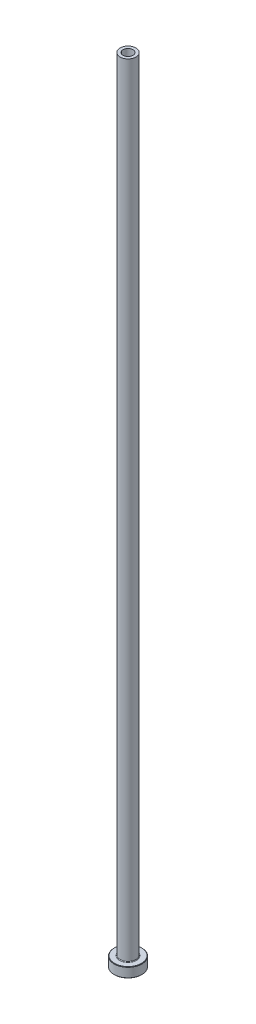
ISO-10303-21;
HEADER;
FILE_DESCRIPTION(('STEP AP214'),'2;1');
FILE_NAME('part.step','',(''),(''),'','','');
FILE_SCHEMA(('AUTOMOTIVE_DESIGN { 1 0 10303 214 1 1 1 1 }'));
ENDSEC;
DATA;
#1=APPLICATION_CONTEXT('core data for automotive mechanical design processes');
#2=APPLICATION_PROTOCOL_DEFINITION('international standard','automotive_design',2000,#1);
#3=PRODUCT_CONTEXT('',#1,'mechanical');
#4=PRODUCT('Part','Part','',(#3));
#5=PRODUCT_RELATED_PRODUCT_CATEGORY('part','',(#4));
#6=PRODUCT_DEFINITION_FORMATION('','',#4);
#7=PRODUCT_DEFINITION_CONTEXT('part definition',#1,'design');
#8=PRODUCT_DEFINITION('design','',#6,#7);
#9=PRODUCT_DEFINITION_SHAPE('','',#8);
#10=(LENGTH_UNIT() NAMED_UNIT(*) SI_UNIT(.MILLI.,.METRE.));
#11=(NAMED_UNIT(*) PLANE_ANGLE_UNIT() SI_UNIT($,.RADIAN.));
#12=(NAMED_UNIT(*) SI_UNIT($,.STERADIAN.) SOLID_ANGLE_UNIT());
#13=UNCERTAINTY_MEASURE_WITH_UNIT(LENGTH_MEASURE(1.E-05),#10,'distance_accuracy_value','');
#14=(GEOMETRIC_REPRESENTATION_CONTEXT(3) GLOBAL_UNCERTAINTY_ASSIGNED_CONTEXT((#13)) GLOBAL_UNIT_ASSIGNED_CONTEXT((#10,
#11,#12)) REPRESENTATION_CONTEXT('',''));
#15=CARTESIAN_POINT('',(0.,0.,0.));
#16=DIRECTION('',(0.,0.,1.));
#17=DIRECTION('',(1.,0.,0.));
#18=AXIS2_PLACEMENT_3D('',#15,#16,#17);
#19=CARTESIAN_POINT('',(0.,92.1876809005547,0.));
#20=DIRECTION('',(0.,1.,0.));
#21=DIRECTION('',(0.,0.,1.));
#22=AXIS2_PLACEMENT_3D('',#19,#20,#21);
#23=CYLINDRICAL_SURFACE('',#22,2.50000000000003);
#24=CARTESIAN_POINT('',(0.,400.,0.));
#25=DIRECTION('',(0.,1.,0.));
#26=DIRECTION('',(0.,0.,1.));
#27=AXIS2_PLACEMENT_3D('',#24,#25,#26);
#28=CIRCLE('',#27,2.50000000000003);
#29=CARTESIAN_POINT('',(0.,400.,2.50000000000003));
#30=VERTEX_POINT('',#29);
#31=EDGE_CURVE('E62',#30,#30,#28,.T.);
#32=ORIENTED_EDGE('',*,*,#31,.T.);
#33=EDGE_LOOP('',(#32));
#34=FACE_BOUND('',#33,.T.);
#35=CARTESIAN_POINT('',(0.,355.,0.));
#36=DIRECTION('',(0.,1.,0.));
#37=DIRECTION('',(0.,0.,1.));
#38=AXIS2_PLACEMENT_3D('',#35,#36,#37);
#39=CIRCLE('',#38,2.50000000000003);
#40=CARTESIAN_POINT('',(0.,355.,2.50000000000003));
#41=VERTEX_POINT('',#40);
#42=EDGE_CURVE('E71',#41,#41,#39,.T.);
#43=ORIENTED_EDGE('',*,*,#42,.F.);
#44=EDGE_LOOP('',(#43));
#45=FACE_BOUND('',#44,.T.);
#46=ADVANCED_FACE('F30',(#34,#45),#23,.F.);
#47=CARTESIAN_POINT('',(-2.50000000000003,400.,0.));
#48=DIRECTION('',(0.,1.,0.));
#49=DIRECTION('',(0.,0.,1.));
#50=AXIS2_PLACEMENT_3D('',#47,#48,#49);
#51=PLANE('',#50);
#52=CARTESIAN_POINT('',(0.,400.,0.));
#53=DIRECTION('',(0.,1.,0.));
#54=DIRECTION('',(0.,0.,1.));
#55=AXIS2_PLACEMENT_3D('',#52,#53,#54);
#56=CIRCLE('',#55,4.00000000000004);
#57=CARTESIAN_POINT('',(0.,400.,4.00000000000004));
#58=VERTEX_POINT('',#57);
#59=EDGE_CURVE('E65',#58,#58,#56,.T.);
#60=ORIENTED_EDGE('',*,*,#59,.T.);
#61=EDGE_LOOP('',(#60));
#62=FACE_BOUND('',#61,.T.);
#63=ORIENTED_EDGE('',*,*,#31,.F.);
#64=EDGE_LOOP('',(#63));
#65=FACE_BOUND('',#64,.T.);
#66=ADVANCED_FACE('F79',(#62,#65),#51,.T.);
#67=CARTESIAN_POINT('',(0.,92.1876809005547,0.));
#68=DIRECTION('',(0.,1.,0.));
#69=DIRECTION('',(0.,0.,1.));
#70=AXIS2_PLACEMENT_3D('',#67,#68,#69);
#71=CYLINDRICAL_SURFACE('',#70,4.00000000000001);
#72=CARTESIAN_POINT('',(0.,5.3,0.));
#73=DIRECTION('',(0.,1.,0.));
#74=DIRECTION('',(0.,0.,1.));
#75=AXIS2_PLACEMENT_3D('',#72,#73,#74);
#76=CIRCLE('',#75,4.00000000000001);
#77=CARTESIAN_POINT('',(0.,5.3,4.00000000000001));
#78=VERTEX_POINT('',#77);
#79=EDGE_CURVE('E59',#78,#78,#76,.T.);
#80=ORIENTED_EDGE('',*,*,#79,.T.);
#81=EDGE_LOOP('',(#80));
#82=FACE_BOUND('',#81,.T.);
#83=ORIENTED_EDGE('',*,*,#59,.F.);
#84=EDGE_LOOP('',(#83));
#85=FACE_BOUND('',#84,.T.);
#86=ADVANCED_FACE('F85',(#82,#85),#71,.T.);
#87=CARTESIAN_POINT('',(-3.99999999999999,5.,0.));
#88=DIRECTION('',(0.,1.,0.));
#89=DIRECTION('',(0.,0.,1.));
#90=AXIS2_PLACEMENT_3D('',#87,#88,#89);
#91=PLANE('',#90);
#92=CARTESIAN_POINT('',(0.,5.,0.));
#93=DIRECTION('',(0.,1.,0.));
#94=DIRECTION('',(0.,0.,1.));
#95=AXIS2_PLACEMENT_3D('',#92,#93,#94);
#96=CIRCLE('',#95,6.80000000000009);
#97=CARTESIAN_POINT('',(0.,5.,-6.80000000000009));
#98=VERTEX_POINT('',#97);
#99=EDGE_CURVE('E53',#98,#98,#96,.T.);
#100=ORIENTED_EDGE('',*,*,#99,.T.);
#101=EDGE_LOOP('',(#100));
#102=FACE_BOUND('',#101,.T.);
#103=CARTESIAN_POINT('',(0.,5.,0.));
#104=DIRECTION('',(0.,1.,0.));
#105=DIRECTION('',(0.,0.,1.));
#106=AXIS2_PLACEMENT_3D('',#103,#104,#105);
#107=CIRCLE('',#106,4.30000000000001);
#108=CARTESIAN_POINT('',(0.,5.,4.30000000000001));
#109=VERTEX_POINT('',#108);
#110=EDGE_CURVE('E56',#109,#109,#107,.F.);
#111=ORIENTED_EDGE('',*,*,#110,.T.);
#112=EDGE_LOOP('',(#111));
#113=FACE_BOUND('',#112,.T.);
#114=ADVANCED_FACE('F111',(#102,#113),#91,.T.);
#115=CARTESIAN_POINT('',(0.,92.1876809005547,0.));
#116=DIRECTION('',(0.,1.,0.));
#117=DIRECTION('',(0.,0.,1.));
#118=AXIS2_PLACEMENT_3D('',#115,#116,#117);
#119=CYLINDRICAL_SURFACE('',#118,6.99999999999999);
#120=CARTESIAN_POINT('',(0.,4.80000000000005,0.));
#121=DIRECTION('',(0.,1.,0.));
#122=DIRECTION('',(0.,0.,1.));
#123=AXIS2_PLACEMENT_3D('',#120,#121,#122);
#124=CIRCLE('',#123,6.99999999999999);
#125=CARTESIAN_POINT('',(0.,4.80000000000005,-6.99999999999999));
#126=VERTEX_POINT('',#125);
#127=EDGE_CURVE('E45',#126,#126,#124,.F.);
#128=ORIENTED_EDGE('',*,*,#127,.T.);
#129=EDGE_LOOP('',(#128));
#130=FACE_BOUND('',#129,.T.);
#131=CARTESIAN_POINT('',(0.,0.200000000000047,0.));
#132=DIRECTION('',(0.,-1.,0.));
#133=DIRECTION('',(0.,0.,-1.));
#134=AXIS2_PLACEMENT_3D('',#131,#132,#133);
#135=CIRCLE('',#134,6.99999999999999);
#136=CARTESIAN_POINT('',(0.,0.200000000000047,-6.99999999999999));
#137=VERTEX_POINT('',#136);
#138=EDGE_CURVE('E50',#137,#137,#135,.F.);
#139=ORIENTED_EDGE('',*,*,#138,.T.);
#140=EDGE_LOOP('',(#139));
#141=FACE_BOUND('',#140,.T.);
#142=ADVANCED_FACE('F108',(#130,#141),#119,.T.);
#143=CARTESIAN_POINT('',(-6.99999999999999,0.,0.));
#144=DIRECTION('',(0.,-1.,0.));
#145=DIRECTION('',(0.,0.,-1.));
#146=AXIS2_PLACEMENT_3D('',#143,#144,#145);
#147=PLANE('',#146);
#148=CARTESIAN_POINT('',(0.,0.,0.));
#149=DIRECTION('',(0.,-1.,0.));
#150=DIRECTION('',(0.,0.,-1.));
#151=AXIS2_PLACEMENT_3D('',#148,#149,#150);
#152=CIRCLE('',#151,3.24999999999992);
#153=CARTESIAN_POINT('',(0.,0.,-3.24999999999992));
#154=VERTEX_POINT('',#153);
#155=EDGE_CURVE('E37',#154,#154,#152,.F.);
#156=ORIENTED_EDGE('',*,*,#155,.T.);
#157=EDGE_LOOP('',(#156));
#158=FACE_BOUND('',#157,.T.);
#159=CARTESIAN_POINT('',(0.,0.,0.));
#160=DIRECTION('',(0.,-1.,0.));
#161=DIRECTION('',(0.,0.,-1.));
#162=AXIS2_PLACEMENT_3D('',#159,#160,#161);
#163=CIRCLE('',#162,6.79999999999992);
#164=CARTESIAN_POINT('',(0.,0.,-6.79999999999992));
#165=VERTEX_POINT('',#164);
#166=EDGE_CURVE('E41',#165,#165,#163,.T.);
#167=ORIENTED_EDGE('',*,*,#166,.T.);
#168=EDGE_LOOP('',(#167));
#169=FACE_BOUND('',#168,.T.);
#170=ADVANCED_FACE('F110',(#158,#169),#147,.T.);
#171=CARTESIAN_POINT('',(0.,92.1876809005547,0.));
#172=DIRECTION('',(0.,1.,0.));
#173=DIRECTION('',(0.,0.,1.));
#174=AXIS2_PLACEMENT_3D('',#171,#172,#173);
#175=CYLINDRICAL_SURFACE('',#174,2.75000000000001);
#176=CARTESIAN_POINT('',(0.,0.499999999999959,0.));
#177=DIRECTION('',(0.,-1.,0.));
#178=DIRECTION('',(0.,0.,-1.));
#179=AXIS2_PLACEMENT_3D('',#176,#177,#178);
#180=CIRCLE('',#179,2.75000000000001);
#181=CARTESIAN_POINT('',(0.,0.499999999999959,-2.75000000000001));
#182=VERTEX_POINT('',#181);
#183=EDGE_CURVE('E10',#182,#182,#180,.T.);
#184=ORIENTED_EDGE('',*,*,#183,.T.);
#185=EDGE_LOOP('',(#184));
#186=FACE_BOUND('',#185,.T.);
#187=CARTESIAN_POINT('',(0.,343.,0.));
#188=DIRECTION('',(0.,1.,0.));
#189=DIRECTION('',(0.,0.,1.));
#190=AXIS2_PLACEMENT_3D('',#187,#188,#189);
#191=CIRCLE('',#190,2.75000000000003);
#192=CARTESIAN_POINT('',(0.,343.,2.75000000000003));
#193=VERTEX_POINT('',#192);
#194=EDGE_CURVE('E68',#193,#193,#191,.T.);
#195=ORIENTED_EDGE('',*,*,#194,.T.);
#196=EDGE_LOOP('',(#195));
#197=FACE_BOUND('',#196,.T.);
#198=ADVANCED_FACE('F118',(#186,#197),#175,.F.);
#199=CARTESIAN_POINT('',(0.,343.,0.));
#200=DIRECTION('',(0.,-1.,0.));
#201=DIRECTION('',(0.,0.,-1.));
#202=AXIS2_PLACEMENT_3D('',#199,#200,#201);
#203=CONICAL_SURFACE('',#202,2.75000000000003,0.0208303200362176);
#204=ORIENTED_EDGE('',*,*,#42,.T.);
#205=EDGE_LOOP('',(#204));
#206=FACE_BOUND('',#205,.T.);
#207=ORIENTED_EDGE('',*,*,#194,.F.);
#208=EDGE_LOOP('',(#207));
#209=FACE_BOUND('',#208,.T.);
#210=ADVANCED_FACE('F75',(#206,#209),#203,.F.);
#211=CARTESIAN_POINT('',(0.,5.3,0.));
#212=DIRECTION('',(0.,1.,0.));
#213=DIRECTION('',(0.,0.,1.));
#214=AXIS2_PLACEMENT_3D('',#211,#212,#213);
#215=TOROIDAL_SURFACE('',#214,4.30000000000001,0.3);
#216=ORIENTED_EDGE('',*,*,#110,.F.);
#217=EDGE_LOOP('',(#216));
#218=FACE_BOUND('',#217,.T.);
#219=ORIENTED_EDGE('',*,*,#79,.F.);
#220=EDGE_LOOP('',(#219));
#221=FACE_BOUND('',#220,.T.);
#222=ADVANCED_FACE('F90',(#218,#221),#215,.F.);
#223=CARTESIAN_POINT('',(0.,5.,0.));
#224=DIRECTION('',(0.,-1.,0.));
#225=DIRECTION('',(0.,0.,-1.));
#226=AXIS2_PLACEMENT_3D('',#223,#224,#225);
#227=CONICAL_SURFACE('',#226,6.80000000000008,0.785398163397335);
#228=CARTESIAN_POINT('',(0.,4.80000000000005,-6.99999999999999));
#229=CARTESIAN_POINT('',(0.,4.80208333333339,-6.99791666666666));
#230=CARTESIAN_POINT('',(0.,4.80416666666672,-6.99583333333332));
#231=CARTESIAN_POINT('',(0.,4.80833333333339,-6.99166666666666));
#232=CARTESIAN_POINT('',(0.,4.81041666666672,-6.98958333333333));
#233=CARTESIAN_POINT('',(0.,4.81458333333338,-6.98541666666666));
#234=CARTESIAN_POINT('',(0.,4.81666666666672,-6.98333333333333));
#235=CARTESIAN_POINT('',(0.,4.82083333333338,-6.97916666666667));
#236=CARTESIAN_POINT('',(0.,4.82291666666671,-6.97708333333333));
#237=CARTESIAN_POINT('',(0.,4.82708333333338,-6.97291666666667));
#238=CARTESIAN_POINT('',(0.,4.82916666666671,-6.97083333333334));
#239=CARTESIAN_POINT('',(0.,4.83333333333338,-6.96666666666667));
#240=CARTESIAN_POINT('',(0.,4.83541666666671,-6.96458333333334));
#241=CARTESIAN_POINT('',(0.,4.83958333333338,-6.96041666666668));
#242=CARTESIAN_POINT('',(0.,4.84166666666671,-6.95833333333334));
#243=CARTESIAN_POINT('',(0.,4.84583333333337,-6.95416666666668));
#244=CARTESIAN_POINT('',(0.,4.84791666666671,-6.95208333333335));
#245=CARTESIAN_POINT('',(0.,4.85208333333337,-6.94791666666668));
#246=CARTESIAN_POINT('',(0.,4.85416666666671,-6.94583333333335));
#247=CARTESIAN_POINT('',(0.,4.85833333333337,-6.94166666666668));
#248=CARTESIAN_POINT('',(0.,4.8604166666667,-6.93958333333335));
#249=CARTESIAN_POINT('',(0.,4.86458333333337,-6.93541666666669));
#250=CARTESIAN_POINT('',(0.,4.8666666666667,-6.93333333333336));
#251=CARTESIAN_POINT('',(0.,4.87083333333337,-6.92916666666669));
#252=CARTESIAN_POINT('',(0.,4.8729166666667,-6.92708333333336));
#253=CARTESIAN_POINT('',(0.,4.87708333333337,-6.92291666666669));
#254=CARTESIAN_POINT('',(0.,4.8791666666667,-6.92083333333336));
#255=CARTESIAN_POINT('',(0.,4.88333333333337,-6.9166666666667));
#256=CARTESIAN_POINT('',(0.,4.8854166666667,-6.91458333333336));
#257=CARTESIAN_POINT('',(0.,4.88958333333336,-6.9104166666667));
#258=CARTESIAN_POINT('',(0.,4.8916666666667,-6.90833333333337));
#259=CARTESIAN_POINT('',(0.,4.89583333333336,-6.9041666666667));
#260=CARTESIAN_POINT('',(0.,4.89791666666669,-6.90208333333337));
#261=CARTESIAN_POINT('',(0.,4.90208333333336,-6.89791666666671));
#262=CARTESIAN_POINT('',(0.,4.90416666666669,-6.89583333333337));
#263=CARTESIAN_POINT('',(0.,4.90833333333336,-6.89166666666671));
#264=CARTESIAN_POINT('',(0.,4.91041666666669,-6.88958333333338));
#265=CARTESIAN_POINT('',(0.,4.91458333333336,-6.88541666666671));
#266=CARTESIAN_POINT('',(0.,4.91666666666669,-6.88333333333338));
#267=CARTESIAN_POINT('',(0.,4.92083333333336,-6.87916666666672));
#268=CARTESIAN_POINT('',(0.,4.92291666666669,-6.87708333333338));
#269=CARTESIAN_POINT('',(0.,4.92708333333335,-6.87291666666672));
#270=CARTESIAN_POINT('',(0.,4.92916666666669,-6.87083333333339));
#271=CARTESIAN_POINT('',(0.,4.93333333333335,-6.86666666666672));
#272=CARTESIAN_POINT('',(0.,4.93541666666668,-6.86458333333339));
#273=CARTESIAN_POINT('',(0.,4.93958333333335,-6.86041666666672));
#274=CARTESIAN_POINT('',(0.,4.94166666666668,-6.85833333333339));
#275=CARTESIAN_POINT('',(0.,4.94583333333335,-6.85416666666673));
#276=CARTESIAN_POINT('',(0.,4.94791666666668,-6.8520833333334));
#277=CARTESIAN_POINT('',(0.,4.95208333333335,-6.84791666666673));
#278=CARTESIAN_POINT('',(0.,4.95416666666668,-6.8458333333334));
#279=CARTESIAN_POINT('',(0.,4.95833333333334,-6.84166666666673));
#280=CARTESIAN_POINT('',(0.,4.96041666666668,-6.8395833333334));
#281=CARTESIAN_POINT('',(0.,4.96458333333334,-6.83541666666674));
#282=CARTESIAN_POINT('',(0.,4.96666666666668,-6.8333333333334));
#283=CARTESIAN_POINT('',(0.,4.97083333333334,-6.82916666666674));
#284=CARTESIAN_POINT('',(0.,4.97291666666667,-6.82708333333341));
#285=CARTESIAN_POINT('',(0.,4.97708333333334,-6.82291666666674));
#286=CARTESIAN_POINT('',(0.,4.97916666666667,-6.82083333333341));
#287=CARTESIAN_POINT('',(0.,4.98333333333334,-6.81666666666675));
#288=CARTESIAN_POINT('',(0.,4.98541666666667,-6.81458333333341));
#289=CARTESIAN_POINT('',(0.,4.98958333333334,-6.81041666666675));
#290=CARTESIAN_POINT('',(0.,4.99166666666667,-6.80833333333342));
#291=CARTESIAN_POINT('',(0.,4.99583333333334,-6.80416666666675));
#292=CARTESIAN_POINT('',(0.,4.99791666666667,-6.80208333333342));
#293=CARTESIAN_POINT('',(0.,5.,-6.80000000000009));
#294=B_SPLINE_CURVE_WITH_KNOTS('',3,(#228,#229,#230,#231,#232,#233,#234,#235,#236,#237,#238,
#239,#240,#241,#242,#243,#244,#245,#246,#247,#248,#249,#250,#251,#252,#253,#254,#255,#256,#257,
#258,#259,#260,#261,#262,#263,#264,#265,#266,#267,#268,#269,#270,#271,#272,#273,#274,#275,#276,
#277,#278,#279,#280,#281,#282,#283,#284,#285,#286,#287,#288,#289,#290,#291,#292,#293),
.UNSPECIFIED.,.F.,.F.,(4,2,2,2,2,2,2,2,2,2,2,2,2,2,2,2,2,2,2,2,2,2,2,2,2,2,2,2,2,2,2,2,4),(0.,
0.00883883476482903,0.0176776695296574,0.0265165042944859,0.0353553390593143,0.0441941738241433,
0.0530330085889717,0.0618718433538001,0.070710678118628,0.079549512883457,0.0883883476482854,
0.0972271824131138,0.106066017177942,0.114904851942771,0.1237436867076,0.132582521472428,
0.141421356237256,0.150260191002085,0.159099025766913,0.167937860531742,0.17677669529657,
0.185615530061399,0.194454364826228,0.203293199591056,0.212132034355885,0.220970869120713,
0.229809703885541,0.23864853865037,0.247487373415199,0.256326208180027,0.265165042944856,
0.274003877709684,0.282842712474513),.UNSPECIFIED.);
#295=EDGE_CURVE('BSEAM93',#126,#98,#294,.T.);
#296=ORIENTED_EDGE('',*,*,#127,.F.);
#297=ORIENTED_EDGE('',*,*,#99,.F.);
#298=ORIENTED_EDGE('',*,*,#295,.T.);
#299=ORIENTED_EDGE('',*,*,#295,.F.);
#300=EDGE_LOOP('',(#296,#298,#297,#299));
#301=FACE_BOUND('',#300,.T.);
#302=ADVANCED_FACE('F93',(#301),#227,.T.);
#303=CARTESIAN_POINT('',(0.,0.200000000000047,0.));
#304=DIRECTION('',(0.,1.,0.));
#305=DIRECTION('',(0.,0.,1.));
#306=AXIS2_PLACEMENT_3D('',#303,#304,#305);
#307=CONICAL_SURFACE('',#306,6.99999999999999,0.785398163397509);
#308=ORIENTED_EDGE('',*,*,#166,.F.);
#309=EDGE_LOOP('',(#308));
#310=FACE_BOUND('',#309,.T.);
#311=ORIENTED_EDGE('',*,*,#138,.F.);
#312=EDGE_LOOP('',(#311));
#313=FACE_BOUND('',#312,.T.);
#314=ADVANCED_FACE('F96',(#310,#313),#307,.T.);
#315=CARTESIAN_POINT('',(0.,0.,0.));
#316=DIRECTION('',(0.,-1.,0.));
#317=DIRECTION('',(0.,0.,-1.));
#318=AXIS2_PLACEMENT_3D('',#315,#316,#317);
#319=CONICAL_SURFACE('',#318,3.24999999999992,0.785398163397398);
#320=ORIENTED_EDGE('',*,*,#183,.F.);
#321=EDGE_LOOP('',(#320));
#322=FACE_BOUND('',#321,.T.);
#323=ORIENTED_EDGE('',*,*,#155,.F.);
#324=EDGE_LOOP('',(#323));
#325=FACE_BOUND('',#324,.T.);
#326=ADVANCED_FACE('F32',(#322,#325),#319,.F.);
#327=CLOSED_SHELL('',(#46,#66,#86,#114,#142,#170,#198,#210,#222,#302,#314,#326));
#328=MANIFOLD_SOLID_BREP('B2',#327);
#329=ADVANCED_BREP_SHAPE_REPRESENTATION('',(#18,#328),#14);
#330=SHAPE_DEFINITION_REPRESENTATION(#9,#329);
ENDSEC;
END-ISO-10303-21;
